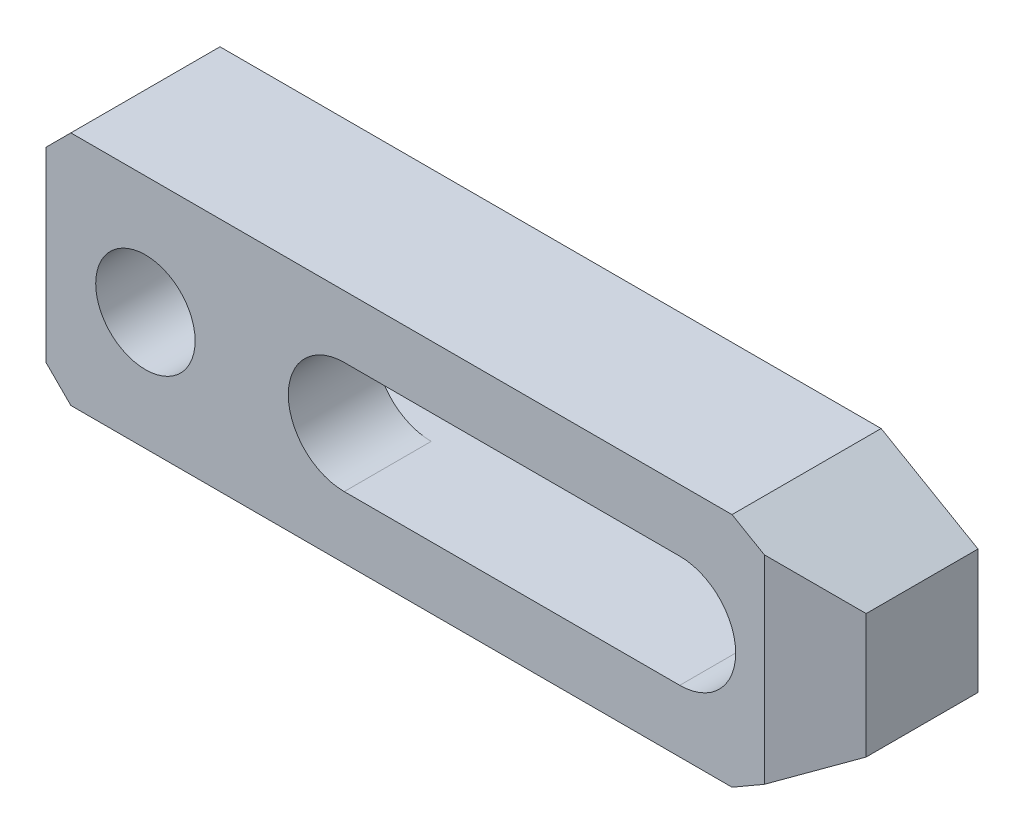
ISO-10303-21;
HEADER;
FILE_DESCRIPTION(('STEP AP214'),'2;1');
FILE_NAME('part.step','',(''),(''),'','','');
FILE_SCHEMA(('AUTOMOTIVE_DESIGN { 1 0 10303 214 1 1 1 1 }'));
ENDSEC;
DATA;
#1=APPLICATION_CONTEXT('core data for automotive mechanical design processes');
#2=APPLICATION_PROTOCOL_DEFINITION('international standard','automotive_design',2000,#1);
#3=PRODUCT_CONTEXT('',#1,'mechanical');
#4=PRODUCT('Part','Part','',(#3));
#5=PRODUCT_RELATED_PRODUCT_CATEGORY('part','',(#4));
#6=PRODUCT_DEFINITION_FORMATION('','',#4);
#7=PRODUCT_DEFINITION_CONTEXT('part definition',#1,'design');
#8=PRODUCT_DEFINITION('design','',#6,#7);
#9=PRODUCT_DEFINITION_SHAPE('','',#8);
#10=(LENGTH_UNIT() NAMED_UNIT(*) SI_UNIT(.MILLI.,.METRE.));
#11=(NAMED_UNIT(*) PLANE_ANGLE_UNIT() SI_UNIT($,.RADIAN.));
#12=(NAMED_UNIT(*) SI_UNIT($,.STERADIAN.) SOLID_ANGLE_UNIT());
#13=UNCERTAINTY_MEASURE_WITH_UNIT(LENGTH_MEASURE(1.E-05),#10,'distance_accuracy_value','');
#14=(GEOMETRIC_REPRESENTATION_CONTEXT(3) GLOBAL_UNCERTAINTY_ASSIGNED_CONTEXT((#13)) GLOBAL_UNIT_ASSIGNED_CONTEXT((#10,
#11,#12)) REPRESENTATION_CONTEXT('',''));
#15=CARTESIAN_POINT('',(0.,0.,0.));
#16=DIRECTION('',(0.,0.,1.));
#17=DIRECTION('',(1.,0.,0.));
#18=AXIS2_PLACEMENT_3D('',#15,#16,#17);
#19=CARTESIAN_POINT('',(-29.5253360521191,28.9746639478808,0.));
#20=DIRECTION('',(0.,0.,1.));
#21=DIRECTION('',(-1.,0.,0.));
#22=AXIS2_PLACEMENT_3D('',#19,#20,#21);
#23=PLANE('',#22);
#24=DIRECTION('',(0.,1.,0.));
#25=VECTOR('',#24,1.);
#26=CARTESIAN_POINT('',(-51.,-7.5,0.));
#27=LINE('',#26,#25);
#28=CARTESIAN_POINT('',(-51.,-7.5,0.));
#29=VERTEX_POINT('',#28);
#30=CARTESIAN_POINT('',(-51.,-4.5,0.));
#31=VERTEX_POINT('',#30);
#32=EDGE_CURVE('E147',#29,#31,#27,.T.);
#33=ORIENTED_EDGE('',*,*,#32,.T.);
#34=DIRECTION('',(-1.,0.,0.));
#35=VECTOR('',#34,1.);
#36=CARTESIAN_POINT('',(0.,-4.5,0.));
#37=LINE('',#36,#35);
#38=CARTESIAN_POINT('',(0.,-4.5,0.));
#39=VERTEX_POINT('',#38);
#40=EDGE_CURVE('E237',#39,#31,#37,.T.);
#41=ORIENTED_EDGE('',*,*,#40,.F.);
#42=CARTESIAN_POINT('',(0.,0.,0.));
#43=DIRECTION('',(0.,0.,1.));
#44=DIRECTION('',(-1.,0.,0.));
#45=AXIS2_PLACEMENT_3D('',#42,#43,#44);
#46=CIRCLE('',#45,4.5);
#47=CARTESIAN_POINT('',(0.,4.5,0.));
#48=VERTEX_POINT('',#47);
#49=EDGE_CURVE('E128',#39,#48,#46,.T.);
#50=ORIENTED_EDGE('',*,*,#49,.T.);
#51=DIRECTION('',(1.,0.,0.));
#52=VECTOR('',#51,1.);
#53=CARTESIAN_POINT('',(-27.,4.5,0.));
#54=LINE('',#53,#52);
#55=CARTESIAN_POINT('',(-51.,4.5,0.));
#56=VERTEX_POINT('',#55);
#57=EDGE_CURVE('E119',#56,#48,#54,.T.);
#58=ORIENTED_EDGE('',*,*,#57,.F.);
#59=CARTESIAN_POINT('',(-51.,7.5,0.));
#60=VERTEX_POINT('',#59);
#61=EDGE_CURVE('E124',#56,#60,#27,.T.);
#62=ORIENTED_EDGE('',*,*,#61,.T.);
#63=DIRECTION('',(-0.707106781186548,-0.707106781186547,0.));
#64=VECTOR('',#63,1.);
#65=CARTESIAN_POINT('',(-49.,9.5,0.));
#66=LINE('',#65,#64);
#67=CARTESIAN_POINT('',(-49.,9.5,0.));
#68=VERTEX_POINT('',#67);
#69=EDGE_CURVE('E148',#68,#60,#66,.T.);
#70=ORIENTED_EDGE('',*,*,#69,.F.);
#71=DIRECTION('',(-1.,0.,0.));
#72=VECTOR('',#71,1.);
#73=CARTESIAN_POINT('',(4.20577136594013,9.5,0.));
#74=LINE('',#73,#72);
#75=CARTESIAN_POINT('',(4.20577136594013,9.5,0.));
#76=VERTEX_POINT('',#75);
#77=EDGE_CURVE('E151',#76,#68,#74,.T.);
#78=ORIENTED_EDGE('',*,*,#77,.F.);
#79=DIRECTION('',(-0.866025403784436,0.5,0.));
#80=VECTOR('',#79,1.);
#81=CARTESIAN_POINT('',(12.,5.,0.));
#82=LINE('',#81,#80);
#83=CARTESIAN_POINT('',(12.,5.,0.));
#84=VERTEX_POINT('',#83);
#85=EDGE_CURVE('E158',#84,#76,#82,.T.);
#86=ORIENTED_EDGE('',*,*,#85,.F.);
#87=DIRECTION('',(0.,-1.,0.));
#88=VECTOR('',#87,1.);
#89=CARTESIAN_POINT('',(12.,5.,0.));
#90=LINE('',#89,#88);
#91=CARTESIAN_POINT('',(12.,-5.,0.));
#92=VERTEX_POINT('',#91);
#93=EDGE_CURVE('E181',#84,#92,#90,.T.);
#94=ORIENTED_EDGE('',*,*,#93,.T.);
#95=DIRECTION('',(-0.86602540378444,-0.5,0.));
#96=VECTOR('',#95,1.);
#97=CARTESIAN_POINT('',(12.,-5.,0.));
#98=LINE('',#97,#96);
#99=CARTESIAN_POINT('',(4.20577136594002,-9.5,0.));
#100=VERTEX_POINT('',#99);
#101=EDGE_CURVE('E208',#92,#100,#98,.T.);
#102=ORIENTED_EDGE('',*,*,#101,.T.);
#103=DIRECTION('',(-1.,0.,0.));
#104=VECTOR('',#103,1.);
#105=CARTESIAN_POINT('',(4.20577136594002,-9.5,0.));
#106=LINE('',#105,#104);
#107=CARTESIAN_POINT('',(-49.,-9.5,0.));
#108=VERTEX_POINT('',#107);
#109=EDGE_CURVE('E210',#100,#108,#106,.T.);
#110=ORIENTED_EDGE('',*,*,#109,.T.);
#111=DIRECTION('',(-0.707106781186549,0.707106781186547,0.));
#112=VECTOR('',#111,1.);
#113=CARTESIAN_POINT('',(-49.,-9.5,0.));
#114=LINE('',#113,#112);
#115=EDGE_CURVE('E150',#108,#29,#114,.T.);
#116=ORIENTED_EDGE('',*,*,#115,.T.);
#117=EDGE_LOOP('',(#33,#41,#50,#58,#62,#70,#78,#86,#94,#102,#110,#116));
#118=FACE_BOUND('',#117,.T.);
#119=ADVANCED_FACE('F14',(#118),#23,.F.);
#120=CARTESIAN_POINT('',(-51.,-7.5,12.));
#121=DIRECTION('',(-1.,0.,0.));
#122=DIRECTION('',(0.,0.,-1.));
#123=AXIS2_PLACEMENT_3D('',#120,#121,#122);
#124=PLANE('',#123);
#125=DIRECTION('',(0.,-1.,0.));
#126=VECTOR('',#125,1.);
#127=CARTESIAN_POINT('',(-51.,-7.5,5.));
#128=LINE('',#127,#126);
#129=CARTESIAN_POINT('',(-51.,4.5,5.));
#130=VERTEX_POINT('',#129);
#131=CARTESIAN_POINT('',(-51.,-4.5,5.));
#132=VERTEX_POINT('',#131);
#133=EDGE_CURVE('E141',#130,#132,#128,.T.);
#134=ORIENTED_EDGE('',*,*,#133,.T.);
#135=DIRECTION('',(0.,0.,-1.));
#136=VECTOR('',#135,1.);
#137=CARTESIAN_POINT('',(-51.,-4.5,12.));
#138=LINE('',#137,#136);
#139=EDGE_CURVE('E140',#132,#31,#138,.T.);
#140=ORIENTED_EDGE('',*,*,#139,.T.);
#141=ORIENTED_EDGE('',*,*,#32,.F.);
#142=DIRECTION('',(0.,0.,-1.));
#143=VECTOR('',#142,1.);
#144=CARTESIAN_POINT('',(-51.,-7.5,12.));
#145=LINE('',#144,#143);
#146=CARTESIAN_POINT('',(-51.,-7.5,12.));
#147=VERTEX_POINT('',#146);
#148=EDGE_CURVE('E189',#147,#29,#145,.T.);
#149=ORIENTED_EDGE('',*,*,#148,.F.);
#150=DIRECTION('',(0.,1.,0.));
#151=VECTOR('',#150,1.);
#152=CARTESIAN_POINT('',(-51.,-7.5,12.));
#153=LINE('',#152,#151);
#154=CARTESIAN_POINT('',(-51.,7.5,12.));
#155=VERTEX_POINT('',#154);
#156=EDGE_CURVE('E171',#147,#155,#153,.T.);
#157=ORIENTED_EDGE('',*,*,#156,.T.);
#158=DIRECTION('',(0.,0.,-1.));
#159=VECTOR('',#158,1.);
#160=CARTESIAN_POINT('',(-51.,7.5,12.));
#161=LINE('',#160,#159);
#162=EDGE_CURVE('E145',#155,#60,#161,.T.);
#163=ORIENTED_EDGE('',*,*,#162,.T.);
#164=ORIENTED_EDGE('',*,*,#61,.F.);
#165=DIRECTION('',(0.,0.,-1.));
#166=VECTOR('',#165,1.);
#167=CARTESIAN_POINT('',(-51.,4.5,12.));
#168=LINE('',#167,#166);
#169=EDGE_CURVE('E135',#130,#56,#168,.T.);
#170=ORIENTED_EDGE('',*,*,#169,.F.);
#171=EDGE_LOOP('',(#134,#140,#141,#149,#157,#163,#164,#170));
#172=FACE_BOUND('',#171,.T.);
#173=ADVANCED_FACE('F143',(#172),#124,.T.);
#174=CARTESIAN_POINT('',(-43.,0.,12.));
#175=DIRECTION('',(0.,0.,-1.));
#176=DIRECTION('',(1.,0.,0.));
#177=AXIS2_PLACEMENT_3D('',#174,#175,#176);
#178=CYLINDRICAL_SURFACE('',#177,4.);
#179=CARTESIAN_POINT('',(-43.,0.,12.));
#180=DIRECTION('',(0.,0.,1.));
#181=DIRECTION('',(-1.,0.,0.));
#182=AXIS2_PLACEMENT_3D('',#179,#180,#181);
#183=CIRCLE('',#182,4.);
#184=CARTESIAN_POINT('',(-47.,0.,12.));
#185=VERTEX_POINT('',#184);
#186=EDGE_CURVE('E161',#185,#185,#183,.T.);
#187=ORIENTED_EDGE('',*,*,#186,.T.);
#188=EDGE_LOOP('',(#187));
#189=FACE_BOUND('',#188,.T.);
#190=CARTESIAN_POINT('',(-43.,0.,5.));
#191=DIRECTION('',(0.,0.,-1.));
#192=DIRECTION('',(1.,0.,0.));
#193=AXIS2_PLACEMENT_3D('',#190,#191,#192);
#194=CIRCLE('',#193,4.);
#195=CARTESIAN_POINT('',(-39.,0.,5.));
#196=VERTEX_POINT('',#195);
#197=EDGE_CURVE('E425',#196,#196,#194,.T.);
#198=ORIENTED_EDGE('',*,*,#197,.T.);
#199=EDGE_LOOP('',(#198));
#200=FACE_BOUND('',#199,.T.);
#201=ADVANCED_FACE('F262',(#189,#200),#178,.F.);
#202=CARTESIAN_POINT('',(-27.,0.,12.));
#203=DIRECTION('',(0.,0.,-1.));
#204=DIRECTION('',(1.,0.,0.));
#205=AXIS2_PLACEMENT_3D('',#202,#203,#204);
#206=CYLINDRICAL_SURFACE('',#205,4.5);
#207=DIRECTION('',(0.,0.,-1.));
#208=VECTOR('',#207,1.);
#209=CARTESIAN_POINT('',(-27.,-4.5,12.));
#210=LINE('',#209,#208);
#211=CARTESIAN_POINT('',(-27.,-4.5,12.));
#212=VERTEX_POINT('',#211);
#213=CARTESIAN_POINT('',(-27.,-4.5,5.));
#214=VERTEX_POINT('',#213);
#215=EDGE_CURVE('E256',#212,#214,#210,.T.);
#216=ORIENTED_EDGE('',*,*,#215,.T.);
#217=CARTESIAN_POINT('',(-27.,0.,5.));
#218=DIRECTION('',(0.,0.,-1.));
#219=DIRECTION('',(1.,0.,0.));
#220=AXIS2_PLACEMENT_3D('',#217,#218,#219);
#221=CIRCLE('',#220,4.5);
#222=CARTESIAN_POINT('',(-27.,4.5,5.));
#223=VERTEX_POINT('',#222);
#224=EDGE_CURVE('E278',#214,#223,#221,.T.);
#225=ORIENTED_EDGE('',*,*,#224,.T.);
#226=DIRECTION('',(0.,0.,-1.));
#227=VECTOR('',#226,1.);
#228=CARTESIAN_POINT('',(-27.,4.5,12.));
#229=LINE('',#228,#227);
#230=CARTESIAN_POINT('',(-27.,4.5,12.));
#231=VERTEX_POINT('',#230);
#232=EDGE_CURVE('E244',#231,#223,#229,.T.);
#233=ORIENTED_EDGE('',*,*,#232,.F.);
#234=CARTESIAN_POINT('',(-27.,0.,12.));
#235=DIRECTION('',(0.,0.,1.));
#236=DIRECTION('',(-1.,0.,0.));
#237=AXIS2_PLACEMENT_3D('',#234,#235,#236);
#238=CIRCLE('',#237,4.5);
#239=EDGE_CURVE('E132',#231,#212,#238,.T.);
#240=ORIENTED_EDGE('',*,*,#239,.T.);
#241=EDGE_LOOP('',(#216,#225,#233,#240));
#242=FACE_BOUND('',#241,.T.);
#243=ADVANCED_FACE('F269',(#242),#206,.F.);
#244=CARTESIAN_POINT('',(-29.5253360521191,28.9746639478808,12.));
#245=DIRECTION('',(0.,0.,1.));
#246=DIRECTION('',(-1.,0.,0.));
#247=AXIS2_PLACEMENT_3D('',#244,#245,#246);
#248=PLANE('',#247);
#249=DIRECTION('',(0.,-1.,0.));
#250=VECTOR('',#249,1.);
#251=CARTESIAN_POINT('',(6.80384757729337,28.9746639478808,12.));
#252=LINE('',#251,#250);
#253=CARTESIAN_POINT('',(6.80384757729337,8.,12.));
#254=VERTEX_POINT('',#253);
#255=CARTESIAN_POINT('',(6.80384757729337,-8.,12.));
#256=VERTEX_POINT('',#255);
#257=EDGE_CURVE('E233',#254,#256,#252,.T.);
#258=ORIENTED_EDGE('',*,*,#257,.F.);
#259=DIRECTION('',(-0.866025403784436,0.5,0.));
#260=VECTOR('',#259,1.);
#261=CARTESIAN_POINT('',(12.,5.,12.));
#262=LINE('',#261,#260);
#263=CARTESIAN_POINT('',(4.20577136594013,9.5,12.));
#264=VERTEX_POINT('',#263);
#265=EDGE_CURVE('E179',#254,#264,#262,.T.);
#266=ORIENTED_EDGE('',*,*,#265,.T.);
#267=DIRECTION('',(-1.,0.,0.));
#268=VECTOR('',#267,1.);
#269=CARTESIAN_POINT('',(4.20577136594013,9.5,12.));
#270=LINE('',#269,#268);
#271=CARTESIAN_POINT('',(-49.,9.5,12.));
#272=VERTEX_POINT('',#271);
#273=EDGE_CURVE('E176',#264,#272,#270,.T.);
#274=ORIENTED_EDGE('',*,*,#273,.T.);
#275=DIRECTION('',(-0.707106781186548,-0.707106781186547,0.));
#276=VECTOR('',#275,1.);
#277=CARTESIAN_POINT('',(-49.,9.5,12.));
#278=LINE('',#277,#276);
#279=EDGE_CURVE('E173',#272,#155,#278,.T.);
#280=ORIENTED_EDGE('',*,*,#279,.T.);
#281=ORIENTED_EDGE('',*,*,#156,.F.);
#282=DIRECTION('',(-0.707106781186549,0.707106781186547,0.));
#283=VECTOR('',#282,1.);
#284=CARTESIAN_POINT('',(-49.,-9.5,12.));
#285=LINE('',#284,#283);
#286=CARTESIAN_POINT('',(-49.,-9.5,12.));
#287=VERTEX_POINT('',#286);
#288=EDGE_CURVE('E168',#287,#147,#285,.T.);
#289=ORIENTED_EDGE('',*,*,#288,.F.);
#290=DIRECTION('',(-1.,0.,0.));
#291=VECTOR('',#290,1.);
#292=CARTESIAN_POINT('',(4.20577136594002,-9.5,12.));
#293=LINE('',#292,#291);
#294=CARTESIAN_POINT('',(4.20577136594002,-9.5,12.));
#295=VERTEX_POINT('',#294);
#296=EDGE_CURVE('E165',#295,#287,#293,.T.);
#297=ORIENTED_EDGE('',*,*,#296,.F.);
#298=DIRECTION('',(-0.86602540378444,-0.5,0.));
#299=VECTOR('',#298,1.);
#300=CARTESIAN_POINT('',(12.,-5.,12.));
#301=LINE('',#300,#299);
#302=EDGE_CURVE('E162',#256,#295,#301,.T.);
#303=ORIENTED_EDGE('',*,*,#302,.F.);
#304=EDGE_LOOP('',(#258,#266,#274,#280,#281,#289,#297,#303));
#305=FACE_BOUND('',#304,.T.);
#306=ORIENTED_EDGE('',*,*,#186,.F.);
#307=EDGE_LOOP('',(#306));
#308=FACE_BOUND('',#307,.T.);
#309=DIRECTION('',(-1.,0.,0.));
#310=VECTOR('',#309,1.);
#311=CARTESIAN_POINT('',(0.,-4.5,12.));
#312=LINE('',#311,#310);
#313=CARTESIAN_POINT('',(0.,-4.5,12.));
#314=VERTEX_POINT('',#313);
#315=EDGE_CURVE('E247',#314,#212,#312,.T.);
#316=ORIENTED_EDGE('',*,*,#315,.T.);
#317=ORIENTED_EDGE('',*,*,#239,.F.);
#318=DIRECTION('',(1.,0.,0.));
#319=VECTOR('',#318,1.);
#320=CARTESIAN_POINT('',(-27.,4.5,12.));
#321=LINE('',#320,#319);
#322=CARTESIAN_POINT('',(0.,4.5,12.));
#323=VERTEX_POINT('',#322);
#324=EDGE_CURVE('E241',#231,#323,#321,.T.);
#325=ORIENTED_EDGE('',*,*,#324,.T.);
#326=CARTESIAN_POINT('',(0.,0.,12.));
#327=DIRECTION('',(0.,0.,1.));
#328=DIRECTION('',(-1.,0.,0.));
#329=AXIS2_PLACEMENT_3D('',#326,#327,#328);
#330=CIRCLE('',#329,4.5);
#331=EDGE_CURVE('E245',#314,#323,#330,.T.);
#332=ORIENTED_EDGE('',*,*,#331,.F.);
#333=EDGE_LOOP('',(#316,#317,#325,#332));
#334=FACE_BOUND('',#333,.T.);
#335=ADVANCED_FACE('F265',(#305,#308,#334),#248,.T.);
#336=CARTESIAN_POINT('',(12.,5.,12.));
#337=DIRECTION('',(-0.5,-0.866025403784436,0.));
#338=DIRECTION('',(0.866025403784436,-0.5,0.));
#339=AXIS2_PLACEMENT_3D('',#336,#337,#338);
#340=PLANE('',#339);
#341=ORIENTED_EDGE('',*,*,#265,.F.);
#342=DIRECTION('',(0.774596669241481,-0.447213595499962,-0.447213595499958));
#343=VECTOR('',#342,1.);
#344=CARTESIAN_POINT('',(10.9607695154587,5.6,9.6));
#345=LINE('',#344,#343);
#346=CARTESIAN_POINT('',(12.,5.,9.));
#347=VERTEX_POINT('',#346);
#348=EDGE_CURVE('E235',#254,#347,#345,.T.);
#349=ORIENTED_EDGE('',*,*,#348,.T.);
#350=DIRECTION('',(0.,0.,-1.));
#351=VECTOR('',#350,1.);
#352=CARTESIAN_POINT('',(12.,5.,12.));
#353=LINE('',#352,#351);
#354=EDGE_CURVE('E164',#347,#84,#353,.T.);
#355=ORIENTED_EDGE('',*,*,#354,.T.);
#356=ORIENTED_EDGE('',*,*,#85,.T.);
#357=DIRECTION('',(0.,0.,-1.));
#358=VECTOR('',#357,1.);
#359=CARTESIAN_POINT('',(4.20577136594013,9.5,12.));
#360=LINE('',#359,#358);
#361=EDGE_CURVE('E9',#264,#76,#360,.T.);
#362=ORIENTED_EDGE('',*,*,#361,.F.);
#363=EDGE_LOOP('',(#341,#349,#355,#356,#362));
#364=FACE_BOUND('',#363,.T.);
#365=ADVANCED_FACE('F268',(#364),#340,.F.);
#366=CARTESIAN_POINT('',(4.20577136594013,9.5,12.));
#367=DIRECTION('',(0.,-1.,0.));
#368=DIRECTION('',(0.,0.,1.));
#369=AXIS2_PLACEMENT_3D('',#366,#367,#368);
#370=PLANE('',#369);
#371=DIRECTION('',(0.,0.,-1.));
#372=VECTOR('',#371,1.);
#373=CARTESIAN_POINT('',(-49.,9.5,12.));
#374=LINE('',#373,#372);
#375=EDGE_CURVE('E22',#272,#68,#374,.T.);
#376=ORIENTED_EDGE('',*,*,#375,.F.);
#377=ORIENTED_EDGE('',*,*,#273,.F.);
#378=ORIENTED_EDGE('',*,*,#361,.T.);
#379=ORIENTED_EDGE('',*,*,#77,.T.);
#380=EDGE_LOOP('',(#376,#377,#378,#379));
#381=FACE_BOUND('',#380,.T.);
#382=ADVANCED_FACE('F16',(#381),#370,.F.);
#383=CARTESIAN_POINT('',(-49.,9.5,12.));
#384=DIRECTION('',(0.707106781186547,-0.707106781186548,0.));
#385=DIRECTION('',(0.707106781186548,0.707106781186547,0.));
#386=AXIS2_PLACEMENT_3D('',#383,#384,#385);
#387=PLANE('',#386);
#388=ORIENTED_EDGE('',*,*,#162,.F.);
#389=ORIENTED_EDGE('',*,*,#279,.F.);
#390=ORIENTED_EDGE('',*,*,#375,.T.);
#391=ORIENTED_EDGE('',*,*,#69,.T.);
#392=EDGE_LOOP('',(#388,#389,#390,#391));
#393=FACE_BOUND('',#392,.T.);
#394=ADVANCED_FACE('F193',(#393),#387,.F.);
#395=CARTESIAN_POINT('',(-49.,-9.5,12.));
#396=DIRECTION('',(-0.707106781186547,-0.707106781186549,0.));
#397=DIRECTION('',(0.707106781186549,-0.707106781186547,0.));
#398=AXIS2_PLACEMENT_3D('',#395,#396,#397);
#399=PLANE('',#398);
#400=DIRECTION('',(0.,0.,-1.));
#401=VECTOR('',#400,1.);
#402=CARTESIAN_POINT('',(-49.,-9.5,12.));
#403=LINE('',#402,#401);
#404=EDGE_CURVE('E187',#287,#108,#403,.T.);
#405=ORIENTED_EDGE('',*,*,#404,.F.);
#406=ORIENTED_EDGE('',*,*,#288,.T.);
#407=ORIENTED_EDGE('',*,*,#148,.T.);
#408=ORIENTED_EDGE('',*,*,#115,.F.);
#409=EDGE_LOOP('',(#405,#406,#407,#408));
#410=FACE_BOUND('',#409,.T.);
#411=ADVANCED_FACE('F220',(#410),#399,.T.);
#412=CARTESIAN_POINT('',(4.20577136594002,-9.5,12.));
#413=DIRECTION('',(0.,-1.,0.));
#414=DIRECTION('',(1.,0.,0.));
#415=AXIS2_PLACEMENT_3D('',#412,#413,#414);
#416=PLANE('',#415);
#417=DIRECTION('',(0.,0.,-1.));
#418=VECTOR('',#417,1.);
#419=CARTESIAN_POINT('',(4.20577136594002,-9.5,12.));
#420=LINE('',#419,#418);
#421=EDGE_CURVE('E185',#295,#100,#420,.T.);
#422=ORIENTED_EDGE('',*,*,#421,.F.);
#423=ORIENTED_EDGE('',*,*,#296,.T.);
#424=ORIENTED_EDGE('',*,*,#404,.T.);
#425=ORIENTED_EDGE('',*,*,#109,.F.);
#426=EDGE_LOOP('',(#422,#423,#424,#425));
#427=FACE_BOUND('',#426,.T.);
#428=ADVANCED_FACE('F306',(#427),#416,.T.);
#429=CARTESIAN_POINT('',(12.,-5.,12.));
#430=DIRECTION('',(0.5,-0.86602540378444,0.));
#431=DIRECTION('',(0.86602540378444,0.5,0.));
#432=AXIS2_PLACEMENT_3D('',#429,#430,#431);
#433=PLANE('',#432);
#434=DIRECTION('',(0.774596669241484,0.447213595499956,-0.44721359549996));
#435=VECTOR('',#434,1.);
#436=CARTESIAN_POINT('',(10.9607695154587,-5.6,9.6));
#437=LINE('',#436,#435);
#438=CARTESIAN_POINT('',(12.,-5.,9.));
#439=VERTEX_POINT('',#438);
#440=EDGE_CURVE('E37',#256,#439,#437,.T.);
#441=ORIENTED_EDGE('',*,*,#440,.F.);
#442=ORIENTED_EDGE('',*,*,#302,.T.);
#443=ORIENTED_EDGE('',*,*,#421,.T.);
#444=ORIENTED_EDGE('',*,*,#101,.F.);
#445=DIRECTION('',(0.,0.,-1.));
#446=VECTOR('',#445,1.);
#447=CARTESIAN_POINT('',(12.,-5.,12.));
#448=LINE('',#447,#446);
#449=EDGE_CURVE('E183',#439,#92,#448,.T.);
#450=ORIENTED_EDGE('',*,*,#449,.F.);
#451=EDGE_LOOP('',(#441,#442,#443,#444,#450));
#452=FACE_BOUND('',#451,.T.);
#453=ADVANCED_FACE('F303',(#452),#433,.T.);
#454=CARTESIAN_POINT('',(12.,5.,12.));
#455=DIRECTION('',(1.,0.,0.));
#456=DIRECTION('',(0.,0.,1.));
#457=AXIS2_PLACEMENT_3D('',#454,#455,#456);
#458=PLANE('',#457);
#459=DIRECTION('',(0.,-1.,0.));
#460=VECTOR('',#459,1.);
#461=CARTESIAN_POINT('',(12.,20.,9.));
#462=LINE('',#461,#460);
#463=EDGE_CURVE('E227',#347,#439,#462,.T.);
#464=ORIENTED_EDGE('',*,*,#463,.T.);
#465=ORIENTED_EDGE('',*,*,#449,.T.);
#466=ORIENTED_EDGE('',*,*,#93,.F.);
#467=ORIENTED_EDGE('',*,*,#354,.F.);
#468=EDGE_LOOP('',(#464,#465,#466,#467));
#469=FACE_BOUND('',#468,.T.);
#470=ADVANCED_FACE('F205',(#469),#458,.T.);
#471=CARTESIAN_POINT('',(0.,-4.5,12.));
#472=DIRECTION('',(0.,-1.,0.));
#473=DIRECTION('',(1.,0.,0.));
#474=AXIS2_PLACEMENT_3D('',#471,#472,#473);
#475=PLANE('',#474);
#476=ORIENTED_EDGE('',*,*,#40,.T.);
#477=ORIENTED_EDGE('',*,*,#139,.F.);
#478=DIRECTION('',(1.,0.,0.));
#479=VECTOR('',#478,1.);
#480=CARTESIAN_POINT('',(-58.,-4.5,5.));
#481=LINE('',#480,#479);
#482=EDGE_CURVE('E276',#132,#214,#481,.T.);
#483=ORIENTED_EDGE('',*,*,#482,.T.);
#484=ORIENTED_EDGE('',*,*,#215,.F.);
#485=ORIENTED_EDGE('',*,*,#315,.F.);
#486=DIRECTION('',(0.,0.,-1.));
#487=VECTOR('',#486,1.);
#488=CARTESIAN_POINT('',(0.,-4.5,12.));
#489=LINE('',#488,#487);
#490=EDGE_CURVE('E255',#314,#39,#489,.T.);
#491=ORIENTED_EDGE('',*,*,#490,.T.);
#492=EDGE_LOOP('',(#476,#477,#483,#484,#485,#491));
#493=FACE_BOUND('',#492,.T.);
#494=ADVANCED_FACE('F275',(#493),#475,.F.);
#495=CARTESIAN_POINT('',(0.,0.,12.));
#496=DIRECTION('',(0.,0.,-1.));
#497=DIRECTION('',(1.,0.,0.));
#498=AXIS2_PLACEMENT_3D('',#495,#496,#497);
#499=CYLINDRICAL_SURFACE('',#498,4.5);
#500=DIRECTION('',(0.,0.,-1.));
#501=VECTOR('',#500,1.);
#502=CARTESIAN_POINT('',(0.,4.5,12.));
#503=LINE('',#502,#501);
#504=EDGE_CURVE('E253',#323,#48,#503,.T.);
#505=ORIENTED_EDGE('',*,*,#504,.T.);
#506=ORIENTED_EDGE('',*,*,#49,.F.);
#507=ORIENTED_EDGE('',*,*,#490,.F.);
#508=ORIENTED_EDGE('',*,*,#331,.T.);
#509=EDGE_LOOP('',(#505,#506,#507,#508));
#510=FACE_BOUND('',#509,.T.);
#511=ADVANCED_FACE('F280',(#510),#499,.F.);
#512=CARTESIAN_POINT('',(-27.,4.5,12.));
#513=DIRECTION('',(0.,1.,0.));
#514=DIRECTION('',(0.,0.,-1.));
#515=AXIS2_PLACEMENT_3D('',#512,#513,#514);
#516=PLANE('',#515);
#517=ORIENTED_EDGE('',*,*,#57,.T.);
#518=ORIENTED_EDGE('',*,*,#504,.F.);
#519=ORIENTED_EDGE('',*,*,#324,.F.);
#520=ORIENTED_EDGE('',*,*,#232,.T.);
#521=DIRECTION('',(1.,0.,0.));
#522=VECTOR('',#521,1.);
#523=CARTESIAN_POINT('',(-58.,4.5,5.));
#524=LINE('',#523,#522);
#525=EDGE_CURVE('E29',#130,#223,#524,.T.);
#526=ORIENTED_EDGE('',*,*,#525,.F.);
#527=ORIENTED_EDGE('',*,*,#169,.T.);
#528=EDGE_LOOP('',(#517,#518,#519,#520,#526,#527));
#529=FACE_BOUND('',#528,.T.);
#530=ADVANCED_FACE('F136',(#529),#516,.F.);
#531=CARTESIAN_POINT('',(-0.124355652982,20.,16.));
#532=DIRECTION('',(-0.5,0.,-0.866025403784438));
#533=DIRECTION('',(0.866025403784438,0.,-0.5));
#534=AXIS2_PLACEMENT_3D('',#531,#532,#533);
#535=PLANE('',#534);
#536=ORIENTED_EDGE('',*,*,#257,.T.);
#537=ORIENTED_EDGE('',*,*,#440,.T.);
#538=ORIENTED_EDGE('',*,*,#463,.F.);
#539=ORIENTED_EDGE('',*,*,#348,.F.);
#540=EDGE_LOOP('',(#536,#537,#538,#539));
#541=FACE_BOUND('',#540,.T.);
#542=ADVANCED_FACE('F288',(#541),#535,.F.);
#543=CARTESIAN_POINT('',(-58.,-4.5,5.));
#544=DIRECTION('',(0.,0.,-1.));
#545=DIRECTION('',(1.,0.,0.));
#546=AXIS2_PLACEMENT_3D('',#543,#544,#545);
#547=PLANE('',#546);
#548=ORIENTED_EDGE('',*,*,#197,.F.);
#549=EDGE_LOOP('',(#548));
#550=FACE_BOUND('',#549,.T.);
#551=ORIENTED_EDGE('',*,*,#525,.T.);
#552=ORIENTED_EDGE('',*,*,#224,.F.);
#553=ORIENTED_EDGE('',*,*,#482,.F.);
#554=ORIENTED_EDGE('',*,*,#133,.F.);
#555=EDGE_LOOP('',(#551,#552,#553,#554));
#556=FACE_BOUND('',#555,.T.);
#557=ADVANCED_FACE('F410',(#550,#556),#547,.T.);
#558=CLOSED_SHELL('',(#119,#173,#201,#243,#335,#365,#382,#394,#411,#428,#453,#470,#494,#511,
#530,#542,#557));
#559=MANIFOLD_SOLID_BREP('B1',#558);
#560=ADVANCED_BREP_SHAPE_REPRESENTATION('',(#18,#559),#14);
#561=SHAPE_DEFINITION_REPRESENTATION(#9,#560);
ENDSEC;
END-ISO-10303-21;
